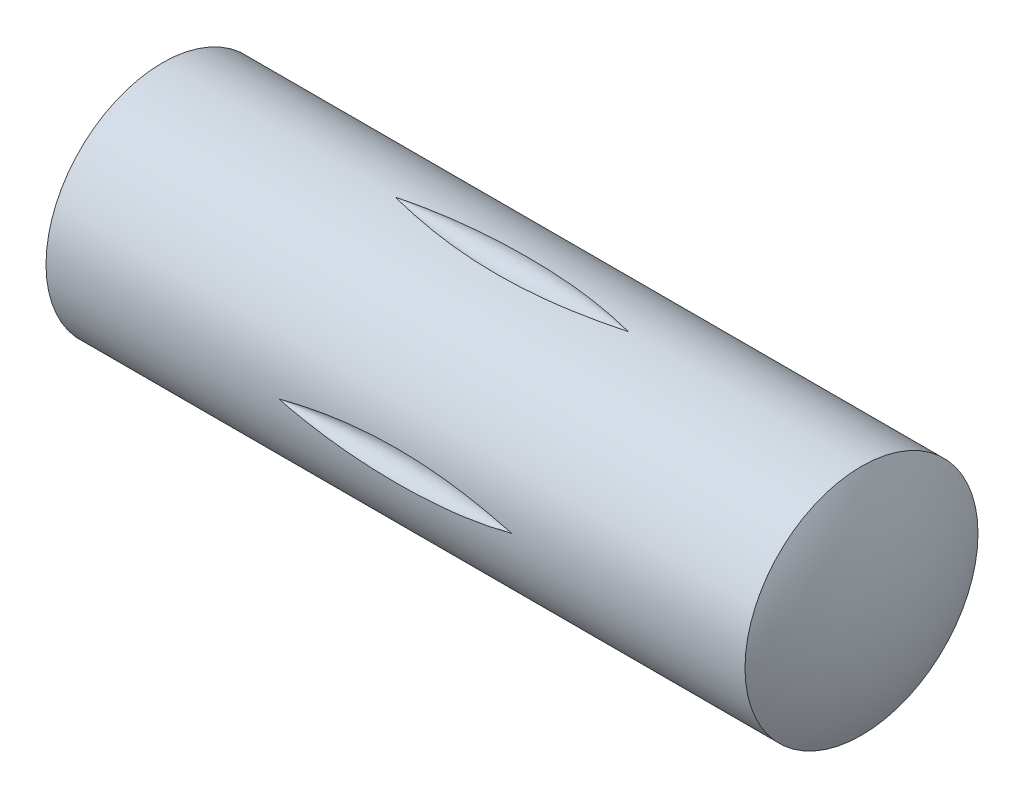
ISO-10303-21;
HEADER;
FILE_DESCRIPTION(('STEP AP214'),'2;1');
FILE_NAME('part.step','',(''),(''),'','','');
FILE_SCHEMA(('AUTOMOTIVE_DESIGN { 1 0 10303 214 1 1 1 1 }'));
ENDSEC;
DATA;
#1=APPLICATION_CONTEXT('core data for automotive mechanical design processes');
#2=APPLICATION_PROTOCOL_DEFINITION('international standard','automotive_design',2000,#1);
#3=PRODUCT_CONTEXT('',#1,'mechanical');
#4=PRODUCT('Part','Part','',(#3));
#5=PRODUCT_RELATED_PRODUCT_CATEGORY('part','',(#4));
#6=PRODUCT_DEFINITION_FORMATION('','',#4);
#7=PRODUCT_DEFINITION_CONTEXT('part definition',#1,'design');
#8=PRODUCT_DEFINITION('design','',#6,#7);
#9=PRODUCT_DEFINITION_SHAPE('','',#8);
#10=(LENGTH_UNIT() NAMED_UNIT(*) SI_UNIT(.MILLI.,.METRE.));
#11=(NAMED_UNIT(*) PLANE_ANGLE_UNIT() SI_UNIT($,.RADIAN.));
#12=(NAMED_UNIT(*) SI_UNIT($,.STERADIAN.) SOLID_ANGLE_UNIT());
#13=UNCERTAINTY_MEASURE_WITH_UNIT(LENGTH_MEASURE(1.E-05),#10,'distance_accuracy_value','');
#14=(GEOMETRIC_REPRESENTATION_CONTEXT(3) GLOBAL_UNCERTAINTY_ASSIGNED_CONTEXT((#13)) GLOBAL_UNIT_ASSIGNED_CONTEXT((#10,
#11,#12)) REPRESENTATION_CONTEXT('',''));
#15=CARTESIAN_POINT('',(0.,0.,0.));
#16=DIRECTION('',(0.,0.,1.));
#17=DIRECTION('',(1.,0.,0.));
#18=AXIS2_PLACEMENT_3D('',#15,#16,#17);
#19=CARTESIAN_POINT('',(10.2653846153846,0.,0.));
#20=DIRECTION('',(-1.,0.,0.));
#21=DIRECTION('',(0.,-1.,0.));
#22=AXIS2_PLACEMENT_3D('',#19,#20,#21);
#23=SPHERICAL_SURFACE('',#22,10.2653846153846);
#24=CARTESIAN_POINT('',(1.3,0.,0.));
#25=DIRECTION('',(-1.,0.,0.));
#26=DIRECTION('',(0.,0.,1.));
#27=AXIS2_PLACEMENT_3D('',#24,#25,#26);
#28=CIRCLE('',#27,5.);
#29=CARTESIAN_POINT('',(1.3,0.,5.));
#30=VERTEX_POINT('',#29);
#31=EDGE_CURVE('E94',#30,#30,#28,.T.);
#32=ORIENTED_EDGE('',*,*,#31,.T.);
#33=EDGE_LOOP('',(#32));
#34=FACE_BOUND('',#33,.T.);
#35=ADVANCED_FACE('F34',(#34),#23,.T.);
#36=CARTESIAN_POINT('',(0.,0.,0.));
#37=DIRECTION('',(-1.,0.,0.));
#38=DIRECTION('',(0.,0.,1.));
#39=AXIS2_PLACEMENT_3D('',#36,#37,#38);
#40=CYLINDRICAL_SURFACE('',#39,5.);
#41=CARTESIAN_POINT('',(21.3,0.,5.));
#42=CARTESIAN_POINT('',(21.2999825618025,4.61187213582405E-06,5.));
#43=CARTESIAN_POINT('',(21.2999651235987,9.223720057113E-06,4.99999999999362));
#44=CARTESIAN_POINT('',(21.2998832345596,3.08806339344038E-05,4.99999999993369));
#45=CARTESIAN_POINT('',(21.2998187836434,4.7925394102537E-05,4.99999999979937));
#46=CARTESIAN_POINT('',(21.2994965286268,0.000133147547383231,4.99999999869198));
#47=CARTESIAN_POINT('',(21.2992387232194,0.000201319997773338,4.99999999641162));
#48=CARTESIAN_POINT('',(21.2979496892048,0.000542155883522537,4.99999997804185));
#49=CARTESIAN_POINT('',(21.2969184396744,0.000814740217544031,4.99999994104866));
#50=CARTESIAN_POINT('',(21.2917620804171,0.00217724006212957,4.99999964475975));
#51=CARTESIAN_POINT('',(21.2876366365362,0.00326588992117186,4.99999905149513));
#52=CARTESIAN_POINT('',(21.2670076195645,0.00870239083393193,4.99999431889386));
#53=CARTESIAN_POINT('',(21.2504986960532,0.0130299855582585,4.99998488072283));
#54=CARTESIAN_POINT('',(21.1679250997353,0.0345600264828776,4.99991020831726));
#55=CARTESIAN_POINT('',(21.1017761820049,0.0514379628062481,4.99976252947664));
#56=CARTESIAN_POINT('',(20.7705343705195,0.134104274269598,4.99863973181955));
#57=CARTESIAN_POINT('',(20.5041189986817,0.194677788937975,4.99651145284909));
#58=CARTESIAN_POINT('',(19.9680049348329,0.304750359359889,4.99100933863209));
#59=CARTESIAN_POINT('',(19.6982977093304,0.354207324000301,4.98763089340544));
#60=CARTESIAN_POINT('',(19.1570190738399,0.441697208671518,4.98064558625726));
#61=CARTESIAN_POINT('',(18.8854475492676,0.479729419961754,4.97703871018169));
#62=CARTESIAN_POINT('',(18.3405806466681,0.544379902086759,4.97038307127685));
#63=CARTESIAN_POINT('',(18.067283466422,0.570983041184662,4.96733505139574));
#64=CARTESIAN_POINT('',(17.5197778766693,0.612698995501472,4.96236266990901));
#65=CARTESIAN_POINT('',(17.2455693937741,0.627810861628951,4.96043840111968));
#66=CARTESIAN_POINT('',(16.7325328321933,0.645321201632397,4.95818740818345));
#67=CARTESIAN_POINT('',(16.4937522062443,0.649120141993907,4.95768513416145));
#68=CARTESIAN_POINT('',(16.016194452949,0.64802768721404,4.95782834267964));
#69=CARTESIAN_POINT('',(15.7774173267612,0.643135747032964,4.95847389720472));
#70=CARTESIAN_POINT('',(15.3001267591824,0.624656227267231,4.96083573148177));
#71=CARTESIAN_POINT('',(15.0616134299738,0.611065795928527,4.96255236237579));
#72=CARTESIAN_POINT('',(14.5852367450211,0.575185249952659,4.9668387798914));
#73=CARTESIAN_POINT('',(14.3473734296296,0.552894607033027,4.9694086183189));
#74=CARTESIAN_POINT('',(13.8729768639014,0.499653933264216,4.97504418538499));
#75=CARTESIAN_POINT('',(13.6364421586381,0.46871687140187,4.97810916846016));
#76=CARTESIAN_POINT('',(13.1646644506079,0.398189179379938,4.98424366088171));
#77=CARTESIAN_POINT('',(12.929421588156,0.358597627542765,4.98731317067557));
#78=CARTESIAN_POINT('',(12.2263838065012,0.226919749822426,4.99563239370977));
#79=CARTESIAN_POINT('',(11.7608672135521,0.121883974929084,4.99999966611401));
#80=CARTESIAN_POINT('',(11.300034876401,9.22372012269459E-06,4.99999999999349));
#81=CARTESIAN_POINT('',(11.3000174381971,4.61187214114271E-06,4.99999999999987));
#82=CARTESIAN_POINT('',(11.3,0.,5.));
#83=B_SPLINE_CURVE_WITH_KNOTS('',3,(#41,#42,#43,#44,#45,#46,#47,#48,#49,#50,#51,#52,#53,#54,#55,
#56,#57,#58,#59,#60,#61,#62,#63,#64,#65,#66,#67,#68,#69,#70,#71,#72,#73,#74,#75,#76,#77,#78,#79,
#80,#81,#82),.UNSPECIFIED.,.F.,.F.,(4,2,2,2,2,2,2,2,2,2,2,2,2,2,2,2,2,2,2,2,4),(0.,
5.41132224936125E-05,0.000254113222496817,0.00105411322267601,0.00425411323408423,
0.0170541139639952,0.0682541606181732,0.27305713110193,1.09244401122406,1.91488298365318,
2.7373729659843,3.56094856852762,4.38459218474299,5.10086978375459,5.81719230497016,
6.53374978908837,7.25035078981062,7.96588265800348,8.68149076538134,10.1114642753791,
10.1115183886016),.UNSPECIFIED.);
#84=CARTESIAN_POINT('',(21.3,0.,5.));
#85=VERTEX_POINT('',#84);
#86=CARTESIAN_POINT('',(11.3,0.,5.));
#87=VERTEX_POINT('',#86);
#88=EDGE_CURVE('E11',#85,#87,#83,.T.);
#89=ORIENTED_EDGE('',*,*,#88,.F.);
#90=CARTESIAN_POINT('',(21.3,0.,5.));
#91=CARTESIAN_POINT('',(21.2999825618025,-4.61187203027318E-06,5.));
#92=CARTESIAN_POINT('',(21.2999651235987,-9.22371995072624E-06,4.99999999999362));
#93=CARTESIAN_POINT('',(21.2998832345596,-3.08806338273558E-05,4.99999999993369));
#94=CARTESIAN_POINT('',(21.2998187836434,-4.79253939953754E-05,4.99999999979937));
#95=CARTESIAN_POINT('',(21.2994965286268,-0.000133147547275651,4.99999999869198));
#96=CARTESIAN_POINT('',(21.2992387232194,-0.000201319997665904,4.99999999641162));
#97=CARTESIAN_POINT('',(21.2979496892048,-0.000542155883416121,4.99999997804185));
#98=CARTESIAN_POINT('',(21.2969184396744,-0.000814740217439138,4.99999994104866));
#99=CARTESIAN_POINT('',(21.2917620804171,-0.00217724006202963,4.99999964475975));
#100=CARTESIAN_POINT('',(21.2876366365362,-0.00326588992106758,4.99999905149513));
#101=CARTESIAN_POINT('',(21.2670076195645,-0.00870239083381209,4.99999431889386));
#102=CARTESIAN_POINT('',(21.2504986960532,-0.013029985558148,4.99998488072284));
#103=CARTESIAN_POINT('',(21.1679250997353,-0.0345600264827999,4.99991020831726));
#104=CARTESIAN_POINT('',(21.1017761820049,-0.0514379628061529,4.99976252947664));
#105=CARTESIAN_POINT('',(20.7705343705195,-0.134104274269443,4.99863973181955));
#106=CARTESIAN_POINT('',(20.5041189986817,-0.194677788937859,4.9965114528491));
#107=CARTESIAN_POINT('',(19.968004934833,-0.304750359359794,4.9910093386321));
#108=CARTESIAN_POINT('',(19.6982977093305,-0.354207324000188,4.98763089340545));
#109=CARTESIAN_POINT('',(19.15701907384,-0.441697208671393,4.98064558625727));
#110=CARTESIAN_POINT('',(18.8854475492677,-0.479729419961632,4.9770387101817));
#111=CARTESIAN_POINT('',(18.3405806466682,-0.544379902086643,4.97038307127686));
#112=CARTESIAN_POINT('',(18.0672834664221,-0.570983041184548,4.96733505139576));
#113=CARTESIAN_POINT('',(17.5197778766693,-0.612698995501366,4.96236266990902));
#114=CARTESIAN_POINT('',(17.2455693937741,-0.627810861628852,4.9604384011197));
#115=CARTESIAN_POINT('',(16.7325328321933,-0.645321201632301,4.95818740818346));
#116=CARTESIAN_POINT('',(16.4937522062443,-0.649120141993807,4.95768513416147));
#117=CARTESIAN_POINT('',(16.0161944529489,-0.648027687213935,4.95782834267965));
#118=CARTESIAN_POINT('',(15.7774173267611,-0.643135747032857,4.95847389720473));
#119=CARTESIAN_POINT('',(15.3001267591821,-0.624656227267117,4.96083573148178));
#120=CARTESIAN_POINT('',(15.0616134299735,-0.611065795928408,4.9625523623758));
#121=CARTESIAN_POINT('',(14.5852367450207,-0.575185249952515,4.96683877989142));
#122=CARTESIAN_POINT('',(14.3473734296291,-0.552894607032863,4.96940861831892));
#123=CARTESIAN_POINT('',(13.8729768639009,-0.499653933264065,4.975044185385));
#124=CARTESIAN_POINT('',(13.6364421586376,-0.468716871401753,4.97810916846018));
#125=CARTESIAN_POINT('',(13.1646644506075,-0.398189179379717,4.98424366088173));
#126=CARTESIAN_POINT('',(12.9294215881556,-0.358597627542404,4.98731317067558));
#127=CARTESIAN_POINT('',(12.2263838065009,-0.226919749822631,4.99563239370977));
#128=CARTESIAN_POINT('',(11.7608672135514,-0.121883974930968,4.99999966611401));
#129=CARTESIAN_POINT('',(11.300034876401,-9.2237200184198E-06,4.99999999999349));
#130=CARTESIAN_POINT('',(11.3000174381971,-4.61187203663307E-06,4.99999999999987));
#131=CARTESIAN_POINT('',(11.3,0.,5.));
#132=B_SPLINE_CURVE_WITH_KNOTS('',3,(#90,#91,#92,#93,#94,#95,#96,#97,#98,#99,#100,#101,#102,
#103,#104,#105,#106,#107,#108,#109,#110,#111,#112,#113,#114,#115,#116,#117,#118,#119,#120,#121,
#122,#123,#124,#125,#126,#127,#128,#129,#130,#131),.UNSPECIFIED.,.F.,.F.,(4,2,2,2,2,2,2,2,2,2,2,
2,2,2,2,2,2,2,2,2,4),(0.,5.41132224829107E-05,0.000254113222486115,0.00105411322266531,
0.00425411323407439,0.0170541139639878,0.0682541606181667,0.273057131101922,1.09244401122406,
1.91488298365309,2.73737296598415,3.56094856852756,4.38459218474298,5.10086978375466,
5.81719230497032,6.53374978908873,7.25035078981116,7.96588265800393,8.68149076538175,
10.1114642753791,10.1115183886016),.UNSPECIFIED.);
#133=EDGE_CURVE('E45',#87,#85,#132,.F.);
#134=ORIENTED_EDGE('',*,*,#133,.F.);
#135=EDGE_LOOP('',(#89,#134));
#136=FACE_BOUND('',#135,.T.);
#137=CARTESIAN_POINT('',(21.3,-5.,0.));
#138=CARTESIAN_POINT('',(21.2999825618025,-5.,4.61187211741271E-06));
#139=CARTESIAN_POINT('',(21.2999651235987,-4.99999999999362,9.22372003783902E-06));
#140=CARTESIAN_POINT('',(21.2998832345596,-4.99999999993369,3.08806339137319E-05));
#141=CARTESIAN_POINT('',(21.2998187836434,-4.99999999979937,4.79253940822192E-05));
#142=CARTESIAN_POINT('',(21.2994965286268,-4.99999999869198,0.000133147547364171));
#143=CARTESIAN_POINT('',(21.2992387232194,-4.99999999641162,0.000201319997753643));
#144=CARTESIAN_POINT('',(21.2979496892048,-4.99999997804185,0.000542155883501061));
#145=CARTESIAN_POINT('',(21.2969184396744,-4.99999994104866,0.00081474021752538));
#146=CARTESIAN_POINT('',(21.2917620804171,-4.99999964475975,0.00217724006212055));
#147=CARTESIAN_POINT('',(21.2876366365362,-4.99999905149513,0.00326588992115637));
#148=CARTESIAN_POINT('',(21.2670076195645,-4.99999431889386,0.00870239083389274));
#149=CARTESIAN_POINT('',(21.2504986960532,-4.99998488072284,0.0130299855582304));
#150=CARTESIAN_POINT('',(21.1679250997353,-4.99991020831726,0.0345600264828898));
#151=CARTESIAN_POINT('',(21.1017761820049,-4.99976252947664,0.0514379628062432));
#152=CARTESIAN_POINT('',(20.7705343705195,-4.99863973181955,0.134104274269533));
#153=CARTESIAN_POINT('',(20.5041189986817,-4.99651145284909,0.194677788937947));
#154=CARTESIAN_POINT('',(19.968004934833,-4.99100933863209,0.304750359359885));
#155=CARTESIAN_POINT('',(19.6982977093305,-4.98763089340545,0.354207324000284));
#156=CARTESIAN_POINT('',(19.1570190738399,-4.98064558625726,0.441697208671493));
#157=CARTESIAN_POINT('',(18.8854475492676,-4.9770387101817,0.479729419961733));
#158=CARTESIAN_POINT('',(18.3405806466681,-4.97038307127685,0.544379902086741));
#159=CARTESIAN_POINT('',(18.067283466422,-4.96733505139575,0.570983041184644));
#160=CARTESIAN_POINT('',(17.5197778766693,-4.96236266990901,0.612698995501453));
#161=CARTESIAN_POINT('',(17.2455693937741,-4.96043840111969,0.627810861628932));
#162=CARTESIAN_POINT('',(16.7325328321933,-4.95818740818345,0.645321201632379));
#163=CARTESIAN_POINT('',(16.4937522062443,-4.95768513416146,0.64912014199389));
#164=CARTESIAN_POINT('',(16.016194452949,-4.95782834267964,0.648027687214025));
#165=CARTESIAN_POINT('',(15.7774173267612,-4.95847389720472,0.64313574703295));
#166=CARTESIAN_POINT('',(15.3001267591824,-4.96083573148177,0.624656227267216));
#167=CARTESIAN_POINT('',(15.0616134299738,-4.96255236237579,0.61106579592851));
#168=CARTESIAN_POINT('',(14.5852367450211,-4.9668387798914,0.575185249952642));
#169=CARTESIAN_POINT('',(14.3473734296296,-4.96940861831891,0.552894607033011));
#170=CARTESIAN_POINT('',(13.8729768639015,-4.97504418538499,0.499653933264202));
#171=CARTESIAN_POINT('',(13.6364421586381,-4.97810916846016,0.468716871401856));
#172=CARTESIAN_POINT('',(13.1646644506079,-4.98424366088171,0.398189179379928));
#173=CARTESIAN_POINT('',(12.929421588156,-4.98731317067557,0.358597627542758));
#174=CARTESIAN_POINT('',(12.2263838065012,-4.99563239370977,0.226919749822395));
#175=CARTESIAN_POINT('',(11.7608672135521,-4.99999966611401,0.121883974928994));
#176=CARTESIAN_POINT('',(11.300034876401,-4.99999999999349,9.22372010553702E-06));
#177=CARTESIAN_POINT('',(11.3000174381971,-4.99999999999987,4.61187212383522E-06));
#178=CARTESIAN_POINT('',(11.3,-5.,0.));
#179=B_SPLINE_CURVE_WITH_KNOTS('',3,(#137,#138,#139,#140,#141,#142,#143,#144,#145,#146,#147,
#148,#149,#150,#151,#152,#153,#154,#155,#156,#157,#158,#159,#160,#161,#162,#163,#164,#165,#166,
#167,#168,#169,#170,#171,#172,#173,#174,#175,#176,#177,#178),.UNSPECIFIED.,.F.,.F.,(4,2,2,2,2,2,
2,2,2,2,2,2,2,2,2,2,2,2,2,2,4),(0.,5.41132224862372E-05,0.000254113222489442,
0.00105411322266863,0.00425411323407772,0.0170541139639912,0.0682541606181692,0.273057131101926,
1.09244401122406,1.91488298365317,2.73737296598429,3.56094856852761,4.38459218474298,
5.10086978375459,5.81719230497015,6.53374978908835,7.2503507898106,7.96588265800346,
8.68149076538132,10.1114642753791,10.1115183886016),.UNSPECIFIED.);
#180=CARTESIAN_POINT('',(21.3,-5.,0.));
#181=VERTEX_POINT('',#180);
#182=CARTESIAN_POINT('',(11.3,-5.,0.));
#183=VERTEX_POINT('',#182);
#184=EDGE_CURVE('E56',#181,#183,#179,.T.);
#185=ORIENTED_EDGE('',*,*,#184,.F.);
#186=CARTESIAN_POINT('',(21.3,-5.,0.));
#187=CARTESIAN_POINT('',(21.2999825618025,-5.,-4.61187204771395E-06));
#188=CARTESIAN_POINT('',(21.2999651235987,-4.99999999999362,-9.2237199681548E-06));
#189=CARTESIAN_POINT('',(21.2998832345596,-4.99999999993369,-3.08806338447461E-05));
#190=CARTESIAN_POINT('',(21.2998187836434,-4.99999999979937,-4.79253940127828E-05));
#191=CARTESIAN_POINT('',(21.2994965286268,-4.99999999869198,-0.00013314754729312));
#192=CARTESIAN_POINT('',(21.2992387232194,-4.99999999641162,-0.000201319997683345));
#193=CARTESIAN_POINT('',(21.2979496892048,-4.99999997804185,-0.000542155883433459));
#194=CARTESIAN_POINT('',(21.2969184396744,-4.99999994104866,-0.000814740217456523));
#195=CARTESIAN_POINT('',(21.2917620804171,-4.99999964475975,-0.00217724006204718));
#196=CARTESIAN_POINT('',(21.2876366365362,-4.99999905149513,-0.00326588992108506));
#197=CARTESIAN_POINT('',(21.2670076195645,-4.99999431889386,-0.00870239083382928));
#198=CARTESIAN_POINT('',(21.2504986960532,-4.99998488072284,-0.0130299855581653));
#199=CARTESIAN_POINT('',(21.1679250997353,-4.99991020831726,-0.0345600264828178));
#200=CARTESIAN_POINT('',(21.1017761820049,-4.99976252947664,-0.0514379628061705));
#201=CARTESIAN_POINT('',(20.7705343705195,-4.99863973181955,-0.134104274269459));
#202=CARTESIAN_POINT('',(20.5041189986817,-4.9965114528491,-0.194677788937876));
#203=CARTESIAN_POINT('',(19.9680049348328,-4.99100933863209,-0.304750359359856));
#204=CARTESIAN_POINT('',(19.6982977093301,-4.98763089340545,-0.354207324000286));
#205=CARTESIAN_POINT('',(19.1570190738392,-4.98064558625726,-0.441697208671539));
#206=CARTESIAN_POINT('',(18.8854475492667,-4.97703871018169,-0.479729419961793));
#207=CARTESIAN_POINT('',(18.3405806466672,-4.97038307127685,-0.544379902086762));
#208=CARTESIAN_POINT('',(18.0672834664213,-4.96733505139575,-0.570983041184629));
#209=CARTESIAN_POINT('',(17.519777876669,-4.96236266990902,-0.612698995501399));
#210=CARTESIAN_POINT('',(17.245569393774,-4.96043840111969,-0.62781086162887));
#211=CARTESIAN_POINT('',(16.7325328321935,-4.95818740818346,-0.645321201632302));
#212=CARTESIAN_POINT('',(16.4937522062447,-4.95768513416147,-0.64912014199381));
#213=CARTESIAN_POINT('',(16.0161944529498,-4.95782834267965,-0.648027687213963));
#214=CARTESIAN_POINT('',(15.7774173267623,-4.95847389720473,-0.643135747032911));
#215=CARTESIAN_POINT('',(15.3001267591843,-4.96083573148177,-0.624656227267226));
#216=CARTESIAN_POINT('',(15.0616134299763,-4.96255236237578,-0.611065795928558));
#217=CARTESIAN_POINT('',(14.5852367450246,-4.96683877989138,-0.575185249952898));
#218=CARTESIAN_POINT('',(14.3473734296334,-4.96940861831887,-0.552894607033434));
#219=CARTESIAN_POINT('',(13.8729768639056,-4.97504418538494,-0.49965393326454));
#220=CARTESIAN_POINT('',(13.6364421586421,-4.97810916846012,-0.468716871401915));
#221=CARTESIAN_POINT('',(13.1646644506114,-4.98424366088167,-0.398189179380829));
#222=CARTESIAN_POINT('',(12.929421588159,-4.98731317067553,-0.358597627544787));
#223=CARTESIAN_POINT('',(12.2263838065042,-4.99563239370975,-0.226919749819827));
#224=CARTESIAN_POINT('',(11.7608672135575,-4.99999966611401,-0.121883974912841));
#225=CARTESIAN_POINT('',(11.300034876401,-4.99999999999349,-9.22372003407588E-06));
#226=CARTESIAN_POINT('',(11.3000174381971,-4.99999999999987,-4.61187205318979E-06));
#227=CARTESIAN_POINT('',(11.3,-5.,0.));
#228=B_SPLINE_CURVE_WITH_KNOTS('',3,(#186,#187,#188,#189,#190,#191,#192,#193,#194,#195,#196,
#197,#198,#199,#200,#201,#202,#203,#204,#205,#206,#207,#208,#209,#210,#211,#212,#213,#214,#215,
#216,#217,#218,#219,#220,#221,#222,#223,#224,#225,#226,#227),.UNSPECIFIED.,.F.,.F.,(4,2,2,2,2,2,
2,2,2,2,2,2,2,2,2,2,2,2,2,2,4),(0.,5.41132224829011E-05,0.000254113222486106,0.0010541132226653,
0.00425411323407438,0.0170541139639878,0.0682541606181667,0.273057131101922,1.09244401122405,
1.91488298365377,2.73737296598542,3.56094856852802,4.38459218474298,5.10086978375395,
5.81719230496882,6.53374978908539,7.2503507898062,7.96588265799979,8.68149076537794,
10.1114642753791,10.1115183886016),.UNSPECIFIED.);
#229=EDGE_CURVE('E130',#183,#181,#228,.F.);
#230=ORIENTED_EDGE('',*,*,#229,.F.);
#231=EDGE_LOOP('',(#185,#230));
#232=FACE_BOUND('',#231,.T.);
#233=CARTESIAN_POINT('',(21.3,0.,-5.));
#234=CARTESIAN_POINT('',(21.2999825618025,-4.61187209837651E-06,-5.));
#235=CARTESIAN_POINT('',(21.2999651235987,-9.22372001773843E-06,-4.99999999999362));
#236=CARTESIAN_POINT('',(21.2998832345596,-3.08806338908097E-05,-4.99999999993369));
#237=CARTESIAN_POINT('',(21.2998187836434,-4.79253940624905E-05,-4.99999999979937));
#238=CARTESIAN_POINT('',(21.2994965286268,-0.000133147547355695,-4.99999999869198));
#239=CARTESIAN_POINT('',(21.2992387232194,-0.000201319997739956,-4.99999999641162));
#240=CARTESIAN_POINT('',(21.2979496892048,-0.000542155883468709,-4.99999997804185));
#241=CARTESIAN_POINT('',(21.2969184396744,-0.000814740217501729,-4.99999994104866));
#242=CARTESIAN_POINT('',(21.2917620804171,-0.00217724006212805,-4.99999964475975));
#243=CARTESIAN_POINT('',(21.2876366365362,-0.00326588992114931,-4.99999905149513));
#244=CARTESIAN_POINT('',(21.2670076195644,-0.00870239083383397,-4.99999431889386));
#245=CARTESIAN_POINT('',(21.2504986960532,-0.0130299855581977,-4.99998488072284));
#246=CARTESIAN_POINT('',(21.1679250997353,-0.0345600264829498,-4.99991020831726));
#247=CARTESIAN_POINT('',(21.1017761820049,-0.0514379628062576,-4.99976252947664));
#248=CARTESIAN_POINT('',(20.7705343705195,-0.134104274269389,-4.99863973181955));
#249=CARTESIAN_POINT('',(20.5041189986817,-0.194677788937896,-4.99651145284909));
#250=CARTESIAN_POINT('',(19.9680049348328,-0.304750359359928,-4.99100933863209));
#251=CARTESIAN_POINT('',(19.6982977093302,-0.354207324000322,-4.98763089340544));
#252=CARTESIAN_POINT('',(19.1570190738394,-0.441697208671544,-4.98064558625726));
#253=CARTESIAN_POINT('',(18.885447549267,-0.479729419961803,-4.97703871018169));
#254=CARTESIAN_POINT('',(18.3405806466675,-0.54437990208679,-4.97038307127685));
#255=CARTESIAN_POINT('',(18.0672834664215,-0.570983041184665,-4.96733505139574));
#256=CARTESIAN_POINT('',(17.5197778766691,-0.612698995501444,-4.96236266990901));
#257=CARTESIAN_POINT('',(17.245569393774,-0.627810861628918,-4.96043840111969));
#258=CARTESIAN_POINT('',(16.7325328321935,-0.645321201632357,-4.95818740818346));
#259=CARTESIAN_POINT('',(16.4937522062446,-0.649120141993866,-4.95768513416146));
#260=CARTESIAN_POINT('',(16.0161944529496,-0.648027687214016,-4.95782834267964));
#261=CARTESIAN_POINT('',(15.777417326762,-0.643135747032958,-4.95847389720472));
#262=CARTESIAN_POINT('',(15.3001267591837,-0.624656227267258,-4.96083573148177));
#263=CARTESIAN_POINT('',(15.0616134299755,-0.611065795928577,-4.96255236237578));
#264=CARTESIAN_POINT('',(14.5852367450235,-0.575185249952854,-4.96683877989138));
#265=CARTESIAN_POINT('',(14.3473734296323,-0.55289460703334,-4.96940861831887));
#266=CARTESIAN_POINT('',(13.8729768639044,-0.499653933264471,-4.97504418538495));
#267=CARTESIAN_POINT('',(13.6364421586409,-0.468716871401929,-4.97810916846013));
#268=CARTESIAN_POINT('',(13.1646644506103,-0.398189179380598,-4.98424366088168));
#269=CARTESIAN_POINT('',(12.9294215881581,-0.358597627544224,-4.98731317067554));
#270=CARTESIAN_POINT('',(12.2263838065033,-0.226919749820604,-4.99563239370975));
#271=CARTESIAN_POINT('',(11.760867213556,-0.121883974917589,-4.99999966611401));
#272=CARTESIAN_POINT('',(11.300034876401,-9.22372008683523E-06,-4.99999999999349));
#273=CARTESIAN_POINT('',(11.3000174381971,-4.6118721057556E-06,-4.99999999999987));
#274=CARTESIAN_POINT('',(11.3,0.,-5.));
#275=B_SPLINE_CURVE_WITH_KNOTS('',3,(#233,#234,#235,#236,#237,#238,#239,#240,#241,#242,#243,
#244,#245,#246,#247,#248,#249,#250,#251,#252,#253,#254,#255,#256,#257,#258,#259,#260,#261,#262,
#263,#264,#265,#266,#267,#268,#269,#270,#271,#272,#273,#274),.UNSPECIFIED.,.F.,.F.,(4,2,2,2,2,2,
2,2,2,2,2,2,2,2,2,2,2,2,2,2,4),(0.,5.41132224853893E-05,0.000254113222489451,
0.00105411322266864,0.00425411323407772,0.0170541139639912,0.06825416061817,0.273057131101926,
1.09244401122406,1.91488298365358,2.73737296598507,3.56094856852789,4.38459218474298,
5.10086978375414,5.81719230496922,6.53374978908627,7.2503507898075,7.96588265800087,
8.68149076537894,10.1114642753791,10.1115183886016),.UNSPECIFIED.);
#276=CARTESIAN_POINT('',(21.3,0.,-5.));
#277=VERTEX_POINT('',#276);
#278=CARTESIAN_POINT('',(11.3,0.,-5.));
#279=VERTEX_POINT('',#278);
#280=EDGE_CURVE('E83',#277,#279,#275,.T.);
#281=ORIENTED_EDGE('',*,*,#280,.F.);
#282=CARTESIAN_POINT('',(21.3,0.,-5.));
#283=CARTESIAN_POINT('',(21.2999825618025,4.61187206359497E-06,-5.));
#284=CARTESIAN_POINT('',(21.2999651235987,9.22371998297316E-06,-4.99999999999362));
#285=CARTESIAN_POINT('',(21.2998832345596,3.08806338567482E-05,-4.99999999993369));
#286=CARTESIAN_POINT('',(21.2998187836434,4.79253940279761E-05,-4.99999999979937));
#287=CARTESIAN_POINT('',(21.2994965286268,0.000133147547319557,-4.99999999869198));
#288=CARTESIAN_POINT('',(21.2992387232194,0.000201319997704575,-4.99999999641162));
#289=CARTESIAN_POINT('',(21.2979496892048,0.000542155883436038,-4.99999997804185));
#290=CARTESIAN_POINT('',(21.2969184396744,0.000814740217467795,-4.99999994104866));
#291=CARTESIAN_POINT('',(21.2917620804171,0.0021772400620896,-4.99999964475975));
#292=CARTESIAN_POINT('',(21.2876366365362,0.00326588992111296,-4.99999905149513));
#293=CARTESIAN_POINT('',(21.2670076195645,0.00870239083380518,-4.99999431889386));
#294=CARTESIAN_POINT('',(21.2504986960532,0.0130299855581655,-4.99998488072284));
#295=CARTESIAN_POINT('',(21.1679250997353,0.0345600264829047,-4.99991020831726));
#296=CARTESIAN_POINT('',(21.101776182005,0.0514379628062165,-4.99976252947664));
#297=CARTESIAN_POINT('',(20.7705343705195,0.134104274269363,-4.99863973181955));
#298=CARTESIAN_POINT('',(20.5041189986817,0.194677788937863,-4.9965114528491));
#299=CARTESIAN_POINT('',(19.9680049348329,0.304750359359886,-4.9910093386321));
#300=CARTESIAN_POINT('',(19.6982977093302,0.354207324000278,-4.98763089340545));
#301=CARTESIAN_POINT('',(19.1570190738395,0.441697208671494,-4.98064558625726));
#302=CARTESIAN_POINT('',(18.8854475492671,0.479729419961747,-4.97703871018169));
#303=CARTESIAN_POINT('',(18.3405806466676,0.54437990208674,-4.97038307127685));
#304=CARTESIAN_POINT('',(18.0672834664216,0.570983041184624,-4.96733505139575));
#305=CARTESIAN_POINT('',(17.5197778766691,0.612698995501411,-4.96236266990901));
#306=CARTESIAN_POINT('',(17.2455693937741,0.627810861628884,-4.96043840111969));
#307=CARTESIAN_POINT('',(16.7325328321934,0.645321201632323,-4.95818740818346));
#308=CARTESIAN_POINT('',(16.4937522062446,0.649120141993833,-4.95768513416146));
#309=CARTESIAN_POINT('',(16.0161944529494,0.648027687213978,-4.95782834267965));
#310=CARTESIAN_POINT('',(15.7774173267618,0.643135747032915,-4.95847389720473));
#311=CARTESIAN_POINT('',(15.3001267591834,0.624656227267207,-4.96083573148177));
#312=CARTESIAN_POINT('',(15.0616134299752,0.611065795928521,-4.96255236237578));
#313=CARTESIAN_POINT('',(14.585236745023,0.575185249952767,-4.96683877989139));
#314=CARTESIAN_POINT('',(14.3473734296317,0.552894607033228,-4.96940861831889));
#315=CARTESIAN_POINT('',(13.8729768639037,0.499653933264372,-4.97504418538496));
#316=CARTESIAN_POINT('',(13.6364421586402,0.468716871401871,-4.97810916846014));
#317=CARTESIAN_POINT('',(13.1646644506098,0.398189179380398,-4.98424366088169));
#318=CARTESIAN_POINT('',(12.9294215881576,0.35859762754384,-4.98731317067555));
#319=CARTESIAN_POINT('',(12.2263838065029,0.226919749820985,-4.99563239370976));
#320=CARTESIAN_POINT('',(11.7608672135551,0.121883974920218,-4.99999966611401));
#321=CARTESIAN_POINT('',(11.300034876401,9.22372005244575E-06,-4.99999999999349));
#322=CARTESIAN_POINT('',(11.3000174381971,4.61187207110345E-06,-4.99999999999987));
#323=CARTESIAN_POINT('',(11.3,0.,-5.));
#324=B_SPLINE_CURVE_WITH_KNOTS('',3,(#282,#283,#284,#285,#286,#287,#288,#289,#290,#291,#292,
#293,#294,#295,#296,#297,#298,#299,#300,#301,#302,#303,#304,#305,#306,#307,#308,#309,#310,#311,
#312,#313,#314,#315,#316,#317,#318,#319,#320,#321,#322,#323),.UNSPECIFIED.,.F.,.F.,(4,2,2,2,2,2,
2,2,2,2,2,2,2,2,2,2,2,2,2,2,4),(0.,5.41132224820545E-05,0.000254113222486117,
0.00105411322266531,0.00425411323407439,0.0170541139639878,0.0682541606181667,0.273057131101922,
1.09244401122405,1.91488298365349,2.73737296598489,3.56094856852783,4.38459218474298,
5.10086978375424,5.81719230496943,6.53374978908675,7.25035078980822,7.96588265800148,
8.6814907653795,10.1114642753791,10.1115183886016),.UNSPECIFIED.);
#325=EDGE_CURVE('E119',#279,#277,#324,.F.);
#326=ORIENTED_EDGE('',*,*,#325,.F.);
#327=EDGE_LOOP('',(#281,#326));
#328=FACE_BOUND('',#327,.T.);
#329=CARTESIAN_POINT('',(21.3,5.,0.));
#330=CARTESIAN_POINT('',(21.2999825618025,5.,-4.61187208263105E-06));
#331=CARTESIAN_POINT('',(21.2999651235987,4.99999999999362,-9.22372000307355E-06));
#332=CARTESIAN_POINT('',(21.2998832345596,4.99999999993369,-3.088063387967E-05));
#333=CARTESIAN_POINT('',(21.2998187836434,4.99999999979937,-4.79253940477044E-05));
#334=CARTESIAN_POINT('',(21.2994965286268,4.99999999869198,-0.000133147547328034));
#335=CARTESIAN_POINT('',(21.2992387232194,4.99999999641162,-0.000201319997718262));
#336=CARTESIAN_POINT('',(21.2979496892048,4.99999997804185,-0.00054215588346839));
#337=CARTESIAN_POINT('',(21.2969184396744,4.99999994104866,-0.000814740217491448));
#338=CARTESIAN_POINT('',(21.2917620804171,4.99999964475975,-0.00217724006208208));
#339=CARTESIAN_POINT('',(21.2876366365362,4.99999905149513,-0.00326588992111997));
#340=CARTESIAN_POINT('',(21.2670076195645,4.99999431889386,-0.00870239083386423));
#341=CARTESIAN_POINT('',(21.2504986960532,4.99998488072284,-0.0130299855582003));
#342=CARTESIAN_POINT('',(21.1679250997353,4.99991020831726,-0.0345600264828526));
#343=CARTESIAN_POINT('',(21.1017761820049,4.99976252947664,-0.0514379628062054));
#344=CARTESIAN_POINT('',(20.7705343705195,4.99863973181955,-0.134104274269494));
#345=CARTESIAN_POINT('',(20.5041189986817,4.99651145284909,-0.194677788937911));
#346=CARTESIAN_POINT('',(19.9680049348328,4.99100933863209,-0.304750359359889));
#347=CARTESIAN_POINT('',(19.6982977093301,4.98763089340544,-0.354207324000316));
#348=CARTESIAN_POINT('',(19.1570190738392,4.98064558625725,-0.441697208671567));
#349=CARTESIAN_POINT('',(18.8854475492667,4.97703871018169,-0.47972941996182));
#350=CARTESIAN_POINT('',(18.3405806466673,4.97038307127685,-0.544379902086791));
#351=CARTESIAN_POINT('',(18.0672834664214,4.96733505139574,-0.570983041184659));
#352=CARTESIAN_POINT('',(17.519777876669,4.96236266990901,-0.612698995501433));
#353=CARTESIAN_POINT('',(17.245569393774,4.96043840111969,-0.627810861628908));
#354=CARTESIAN_POINT('',(16.7325328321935,4.95818740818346,-0.645321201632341));
#355=CARTESIAN_POINT('',(16.4937522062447,4.95768513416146,-0.649120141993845));
#356=CARTESIAN_POINT('',(16.0161944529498,4.95782834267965,-0.648027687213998));
#357=CARTESIAN_POINT('',(15.7774173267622,4.95847389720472,-0.643135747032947));
#358=CARTESIAN_POINT('',(15.3001267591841,4.96083573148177,-0.624656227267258));
#359=CARTESIAN_POINT('',(15.0616134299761,4.96255236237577,-0.611065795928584));
#360=CARTESIAN_POINT('',(14.5852367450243,4.96683877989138,-0.575185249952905));
#361=CARTESIAN_POINT('',(14.3473734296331,4.96940861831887,-0.55289460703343));
#362=CARTESIAN_POINT('',(13.8729768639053,4.97504418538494,-0.499653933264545));
#363=CARTESIAN_POINT('',(13.6364421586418,4.97810916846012,-0.468716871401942));
#364=CARTESIAN_POINT('',(13.1646644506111,4.98424366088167,-0.39818917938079));
#365=CARTESIAN_POINT('',(12.9294215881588,4.98731317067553,-0.358597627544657));
#366=CARTESIAN_POINT('',(12.226383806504,4.99563239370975,-0.226919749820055));
#367=CARTESIAN_POINT('',(11.7608672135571,4.99999966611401,-0.121883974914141));
#368=CARTESIAN_POINT('',(11.300034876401,4.99999999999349,-9.22372006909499E-06));
#369=CARTESIAN_POINT('',(11.3000174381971,4.99999999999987,-4.61187208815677E-06));
#370=CARTESIAN_POINT('',(11.3,5.,0.));
#371=B_SPLINE_CURVE_WITH_KNOTS('',3,(#329,#330,#331,#332,#333,#334,#335,#336,#337,#338,#339,
#340,#341,#342,#343,#344,#345,#346,#347,#348,#349,#350,#351,#352,#353,#354,#355,#356,#357,#358,
#359,#360,#361,#362,#363,#364,#365,#366,#367,#368,#369,#370),.UNSPECIFIED.,.F.,.F.,(4,2,2,2,2,2,
2,2,2,2,2,2,2,2,2,2,2,2,2,2,4),(0.,5.41132224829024E-05,0.000254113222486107,0.0010541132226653,
0.00425411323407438,0.0170541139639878,0.0682541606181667,0.273057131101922,1.09244401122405,
1.91488298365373,2.73737296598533,3.56094856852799,4.38459218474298,5.100869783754,
5.81719230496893,6.53374978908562,7.25035078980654,7.96588265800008,8.68149076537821,
10.1114642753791,10.1115183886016),.UNSPECIFIED.);
#372=CARTESIAN_POINT('',(21.3,5.,0.));
#373=VERTEX_POINT('',#372);
#374=CARTESIAN_POINT('',(11.3,5.,0.));
#375=VERTEX_POINT('',#374);
#376=EDGE_CURVE('E87',#373,#375,#371,.T.);
#377=ORIENTED_EDGE('',*,*,#376,.F.);
#378=CARTESIAN_POINT('',(21.3,5.,0.));
#379=CARTESIAN_POINT('',(21.2999825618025,5.,4.61187208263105E-06));
#380=CARTESIAN_POINT('',(21.2999651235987,4.99999999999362,9.22372000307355E-06));
#381=CARTESIAN_POINT('',(21.2998832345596,4.99999999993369,3.088063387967E-05));
#382=CARTESIAN_POINT('',(21.2998187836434,4.99999999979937,4.79253940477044E-05));
#383=CARTESIAN_POINT('',(21.2994965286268,4.99999999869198,0.000133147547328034));
#384=CARTESIAN_POINT('',(21.2992387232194,4.99999999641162,0.000201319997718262));
#385=CARTESIAN_POINT('',(21.2979496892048,4.99999997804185,0.00054215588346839));
#386=CARTESIAN_POINT('',(21.2969184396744,4.99999994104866,0.000814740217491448));
#387=CARTESIAN_POINT('',(21.2917620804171,4.99999964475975,0.00217724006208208));
#388=CARTESIAN_POINT('',(21.2876366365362,4.99999905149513,0.00326588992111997));
#389=CARTESIAN_POINT('',(21.2670076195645,4.99999431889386,0.00870239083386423));
#390=CARTESIAN_POINT('',(21.2504986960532,4.99998488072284,0.0130299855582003));
#391=CARTESIAN_POINT('',(21.1679250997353,4.99991020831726,0.0345600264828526));
#392=CARTESIAN_POINT('',(21.1017761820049,4.99976252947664,0.0514379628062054));
#393=CARTESIAN_POINT('',(20.7705343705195,4.99863973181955,0.134104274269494));
#394=CARTESIAN_POINT('',(20.5041189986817,4.99651145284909,0.194677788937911));
#395=CARTESIAN_POINT('',(19.9680049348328,4.99100933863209,0.304750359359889));
#396=CARTESIAN_POINT('',(19.6982977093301,4.98763089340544,0.354207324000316));
#397=CARTESIAN_POINT('',(19.1570190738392,4.98064558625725,0.441697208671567));
#398=CARTESIAN_POINT('',(18.8854475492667,4.97703871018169,0.47972941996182));
#399=CARTESIAN_POINT('',(18.3405806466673,4.97038307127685,0.544379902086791));
#400=CARTESIAN_POINT('',(18.0672834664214,4.96733505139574,0.570983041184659));
#401=CARTESIAN_POINT('',(17.519777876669,4.96236266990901,0.612698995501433));
#402=CARTESIAN_POINT('',(17.245569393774,4.96043840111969,0.627810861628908));
#403=CARTESIAN_POINT('',(16.7325328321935,4.95818740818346,0.645321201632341));
#404=CARTESIAN_POINT('',(16.4937522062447,4.95768513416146,0.649120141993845));
#405=CARTESIAN_POINT('',(16.0161944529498,4.95782834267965,0.648027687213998));
#406=CARTESIAN_POINT('',(15.7774173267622,4.95847389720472,0.643135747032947));
#407=CARTESIAN_POINT('',(15.3001267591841,4.96083573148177,0.624656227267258));
#408=CARTESIAN_POINT('',(15.0616134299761,4.96255236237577,0.611065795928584));
#409=CARTESIAN_POINT('',(14.5852367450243,4.96683877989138,0.575185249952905));
#410=CARTESIAN_POINT('',(14.3473734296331,4.96940861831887,0.55289460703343));
#411=CARTESIAN_POINT('',(13.8729768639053,4.97504418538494,0.499653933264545));
#412=CARTESIAN_POINT('',(13.6364421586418,4.97810916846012,0.468716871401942));
#413=CARTESIAN_POINT('',(13.1646644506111,4.98424366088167,0.39818917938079));
#414=CARTESIAN_POINT('',(12.9294215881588,4.98731317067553,0.358597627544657));
#415=CARTESIAN_POINT('',(12.226383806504,4.99563239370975,0.226919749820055));
#416=CARTESIAN_POINT('',(11.7608672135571,4.99999966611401,0.121883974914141));
#417=CARTESIAN_POINT('',(11.300034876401,4.99999999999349,9.22372006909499E-06));
#418=CARTESIAN_POINT('',(11.3000174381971,4.99999999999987,4.61187208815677E-06));
#419=CARTESIAN_POINT('',(11.3,5.,0.));
#420=B_SPLINE_CURVE_WITH_KNOTS('',3,(#378,#379,#380,#381,#382,#383,#384,#385,#386,#387,#388,
#389,#390,#391,#392,#393,#394,#395,#396,#397,#398,#399,#400,#401,#402,#403,#404,#405,#406,#407,
#408,#409,#410,#411,#412,#413,#414,#415,#416,#417,#418,#419),.UNSPECIFIED.,.F.,.F.,(4,2,2,2,2,2,
2,2,2,2,2,2,2,2,2,2,2,2,2,2,4),(0.,5.41132224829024E-05,0.000254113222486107,0.0010541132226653,
0.00425411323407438,0.0170541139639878,0.0682541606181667,0.273057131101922,1.09244401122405,
1.91488298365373,2.73737296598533,3.56094856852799,4.38459218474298,5.100869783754,
5.81719230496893,6.53374978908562,7.25035078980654,7.96588265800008,8.68149076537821,
10.1114642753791,10.1115183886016),.UNSPECIFIED.);
#421=EDGE_CURVE('E96',#375,#373,#420,.F.);
#422=ORIENTED_EDGE('',*,*,#421,.F.);
#423=EDGE_LOOP('',(#377,#422));
#424=FACE_BOUND('',#423,.T.);
#425=CARTESIAN_POINT('',(31.3,0.,0.));
#426=DIRECTION('',(-1.,0.,0.));
#427=DIRECTION('',(0.,0.,1.));
#428=AXIS2_PLACEMENT_3D('',#425,#426,#427);
#429=CIRCLE('',#428,5.);
#430=CARTESIAN_POINT('',(31.3,0.,5.));
#431=VERTEX_POINT('',#430);
#432=EDGE_CURVE('E91',#431,#431,#429,.T.);
#433=ORIENTED_EDGE('',*,*,#432,.T.);
#434=EDGE_LOOP('',(#433));
#435=FACE_BOUND('',#434,.T.);
#436=ORIENTED_EDGE('',*,*,#31,.F.);
#437=EDGE_LOOP('',(#436));
#438=FACE_BOUND('',#437,.T.);
#439=ADVANCED_FACE('F75',(#136,#232,#328,#424,#435,#438),#40,.T.);
#440=CARTESIAN_POINT('',(22.3346153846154,0.,0.));
#441=DIRECTION('',(-1.,0.,0.));
#442=DIRECTION('',(0.,1.,0.));
#443=AXIS2_PLACEMENT_3D('',#440,#441,#442);
#444=SPHERICAL_SURFACE('',#443,10.2653846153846);
#445=ORIENTED_EDGE('',*,*,#432,.F.);
#446=EDGE_LOOP('',(#445));
#447=FACE_BOUND('',#446,.T.);
#448=ADVANCED_FACE('F78',(#447),#444,.T.);
#449=CARTESIAN_POINT('',(16.3,5.,-18.9057692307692));
#450=DIRECTION('',(0.,-1.,0.));
#451=DIRECTION('',(0.,0.,1.));
#452=AXIS2_PLACEMENT_3D('',#449,#450,#451);
#453=CIRCLE('',#452,19.5557692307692);
#454=TRIMMED_CURVE('',#453,(PARAMETER_VALUE(-0.258550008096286)),
(PARAMETER_VALUE(0.258550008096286)),.T.,.PARAMETER.);
#455=CARTESIAN_POINT('',(16.3,5.,0.));
#456=DIRECTION('',(-1.,0.,0.));
#457=AXIS1_PLACEMENT('',#455,#456);
#458=SURFACE_OF_REVOLUTION('',#454,#457);
#459=ORIENTED_EDGE('',*,*,#376,.T.);
#460=ORIENTED_EDGE('',*,*,#421,.T.);
#461=EDGE_LOOP('',(#459,#460));
#462=FACE_BOUND('',#461,.T.);
#463=ADVANCED_FACE('F109',(#462),#458,.F.);
#464=CARTESIAN_POINT('',(16.3,-18.9057692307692,-4.99999999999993));
#465=DIRECTION('',(0.,0.,1.));
#466=DIRECTION('',(0.,1.,0.));
#467=AXIS2_PLACEMENT_3D('',#464,#465,#466);
#468=CIRCLE('',#467,19.5557692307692);
#469=TRIMMED_CURVE('',#468,(PARAMETER_VALUE(-0.258550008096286)),
(PARAMETER_VALUE(0.258550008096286)),.T.,.PARAMETER.);
#470=CARTESIAN_POINT('',(16.3,0.,-5.));
#471=DIRECTION('',(-1.,0.,0.));
#472=AXIS1_PLACEMENT('',#470,#471);
#473=SURFACE_OF_REVOLUTION('',#469,#472);
#474=ORIENTED_EDGE('',*,*,#280,.T.);
#475=ORIENTED_EDGE('',*,*,#325,.T.);
#476=EDGE_LOOP('',(#474,#475));
#477=FACE_BOUND('',#476,.T.);
#478=ADVANCED_FACE('F148',(#477),#473,.F.);
#479=CARTESIAN_POINT('',(16.3,-4.99999999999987,18.9057692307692));
#480=DIRECTION('',(0.,1.,0.));
#481=DIRECTION('',(0.,0.,-1.));
#482=AXIS2_PLACEMENT_3D('',#479,#480,#481);
#483=CIRCLE('',#482,19.5557692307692);
#484=TRIMMED_CURVE('',#483,(PARAMETER_VALUE(-0.258550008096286)),
(PARAMETER_VALUE(0.258550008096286)),.T.,.PARAMETER.);
#485=CARTESIAN_POINT('',(16.3,-5.,0.));
#486=DIRECTION('',(-1.,0.,0.));
#487=AXIS1_PLACEMENT('',#485,#486);
#488=SURFACE_OF_REVOLUTION('',#484,#487);
#489=ORIENTED_EDGE('',*,*,#184,.T.);
#490=ORIENTED_EDGE('',*,*,#229,.T.);
#491=EDGE_LOOP('',(#489,#490));
#492=FACE_BOUND('',#491,.T.);
#493=ADVANCED_FACE('F144',(#492),#488,.F.);
#494=CARTESIAN_POINT('',(16.3,18.9057692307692,4.9999999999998));
#495=DIRECTION('',(0.,0.,-1.));
#496=DIRECTION('',(0.,-1.,0.));
#497=AXIS2_PLACEMENT_3D('',#494,#495,#496);
#498=CIRCLE('',#497,19.5557692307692);
#499=TRIMMED_CURVE('',#498,(PARAMETER_VALUE(-0.258550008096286)),
(PARAMETER_VALUE(0.258550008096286)),.T.,.PARAMETER.);
#500=CARTESIAN_POINT('',(16.3,0.,5.));
#501=DIRECTION('',(-1.,0.,0.));
#502=AXIS1_PLACEMENT('',#500,#501);
#503=SURFACE_OF_REVOLUTION('',#499,#502);
#504=ORIENTED_EDGE('',*,*,#88,.T.);
#505=ORIENTED_EDGE('',*,*,#133,.T.);
#506=EDGE_LOOP('',(#504,#505));
#507=FACE_BOUND('',#506,.T.);
#508=ADVANCED_FACE('F73',(#507),#503,.F.);
#509=CLOSED_SHELL('',(#35,#439,#448,#463,#478,#493,#508));
#510=MANIFOLD_SOLID_BREP('B2',#509);
#511=ADVANCED_BREP_SHAPE_REPRESENTATION('',(#18,#510),#14);
#512=SHAPE_DEFINITION_REPRESENTATION(#9,#511);
ENDSEC;
END-ISO-10303-21;
